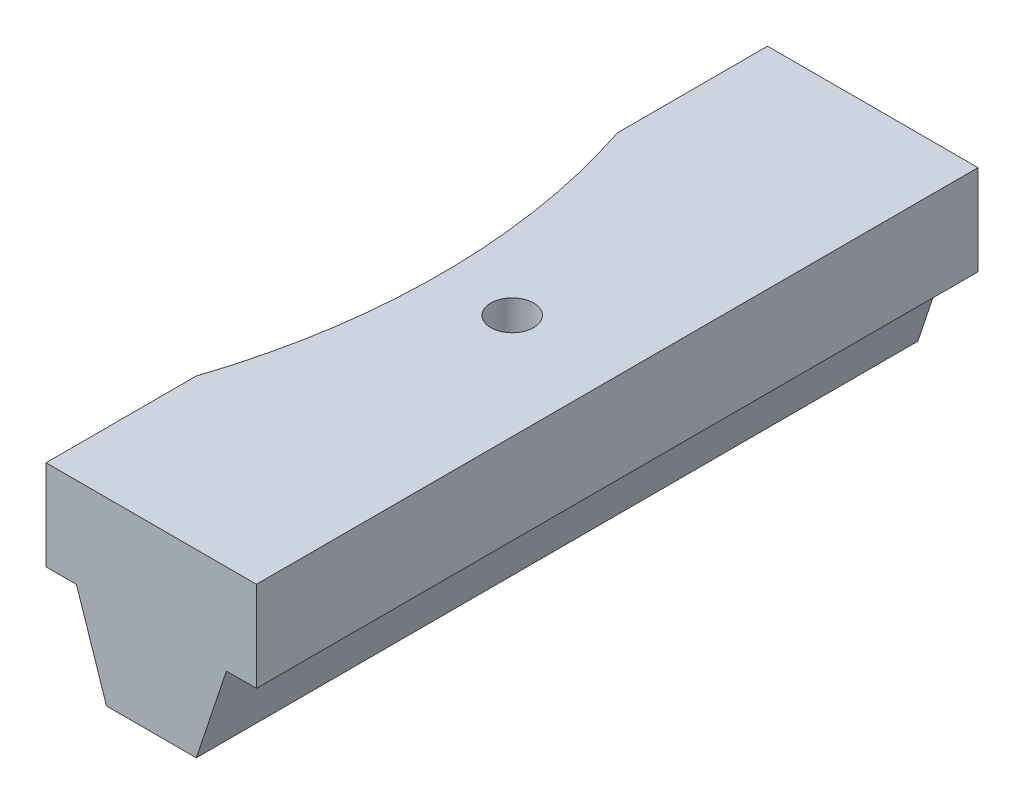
from build123d import *

# Parameters (mm, degrees)
EXTRUDE1_DEPTH        = 19.05
F_4_40_TAPPED_HOLE1_D = 2.2606
SKETCH6_R             = 35.3695
CUT_EXTRUDE1_DEPTH    = 124.46208707


with BuildPart() as part:
    # Sketch1 → Extrude1 (new, symmetric)
    with BuildSketch(Plane.XY):
        Polygon((3.959225, -117.094), (2.371725, -121.8565), (-2.371725, -121.8565), (-3.959225, -117.094), (-5.565775, -117.094), (-5.565775, -112.3315), (5.546725, -112.3315), (5.546725, -117.094), align=None)
    extrude(amount=EXTRUDE1_DEPTH, both=True)

    # 4-40 Tapped Hole1 (through all)
    with Locations(Plane(origin=(-0.290650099, -112.3315, -13.199851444), x_dir=(-1, 0, 0), z_dir=(0, 1, 0))):
        with Locations((-0.290650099, 13.199851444)):
            Hole(F_4_40_TAPPED_HOLE1_D / 2)

    # Sketch6 → Cut-Extrude1 (cut, through all)
    with BuildSketch(Plane(origin=(0, 0, 0), x_dir=(1, 0, 0), z_dir=(0, 1, 0))):
        with Locations((-39.1414, 0)):
            Circle(SKETCH6_R)
    extrude(amount=-CUT_EXTRUDE1_DEPTH, mode=Mode.SUBTRACT)


solid = part.part
